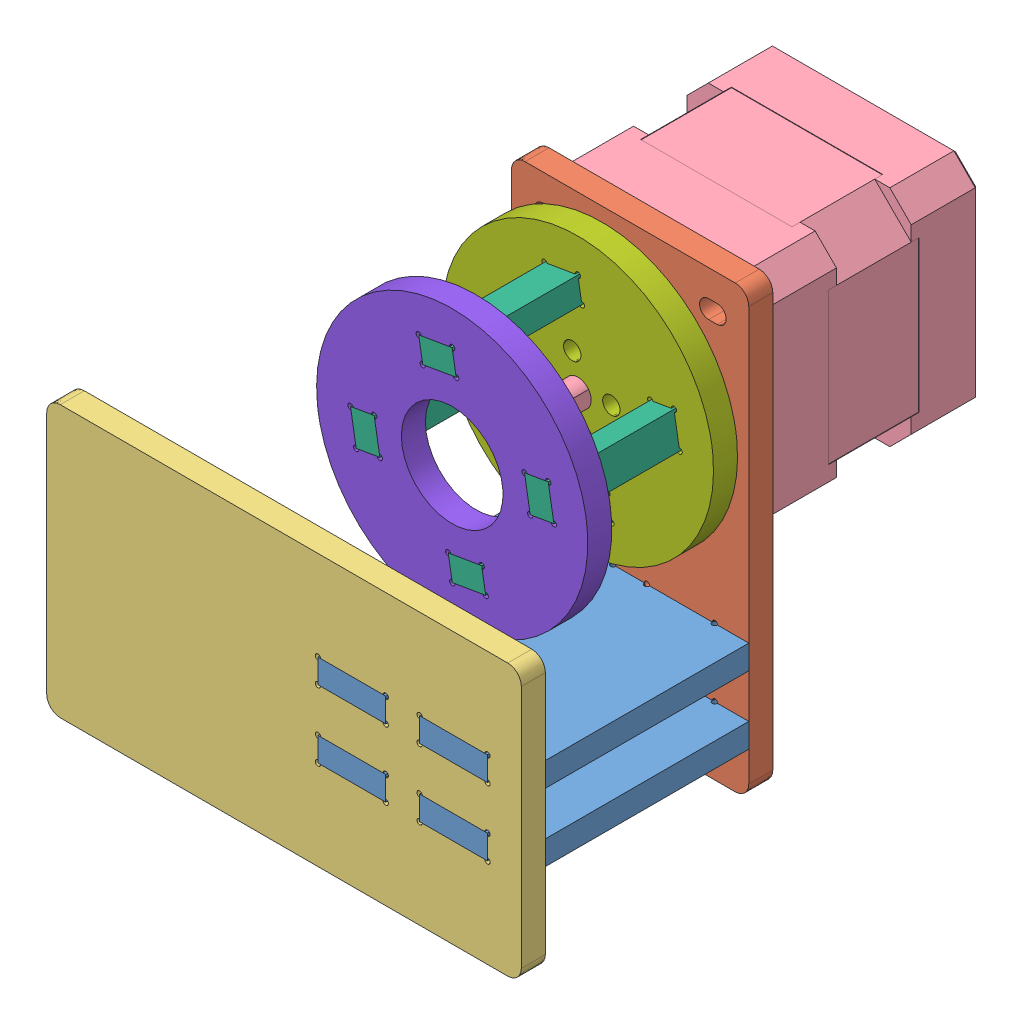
SolidWorks assembly Motor Mount.SLDASM, configuration Default (file format 8000). Lengths in mm.
Overall size (96.62 98.37 86.1).
13 component instances, 8 part files, 20 mates.
Components (placement in the parent):
- Connector-1: Connector.SLDPRT [Default] at (88.9785 7.3991 49.2004) x (0 0 -1) z (1 0 0) size (47.1 4.5 44.45)
- Connector-2: Connector.SLDPRT [Default] at (88.9785 20.0991 49.2004) x (0 0 -1) z (1 0 0) size (47.1 4.5 44.45)
- Motor Faceplate-1: Motor Faceplate.SLDPRT [Default] at (44.5285 -0.8009 6.6004) size (44.45 82.55 4.5)
- Wall Plate-1: Wall Plate.SLDPRT [Default] at (0.0785 41.3991 49.2004) x (0 -1 0) z (0 0 1) size (50.8 88.9 4.5)
- Steppermotor-1: Steppermotor.SLDPRT [Predeterminado] at (67.4035 59.6741 6.6004) x (0 1 0) z (0 0 -1) size (42 42 58.5)
- Motor Hub-1: Motor Hub.SLDPRT [Default] at (67.4035 59.6741 11.9464) x (0.16736 -0.985896 0) z (0 0 1) size (19.05 19.05 5.08)
- PulleyAssembly-1: PulleyAssembly.SLDASM [Default] at (66.5296 9.6823 6.4925) x (0.985896 0.16736 0) z (0 0 1) size (50.8 50.8 28.05)
  - Puller Spacer-1: Puller Spacer.SLDPRT [Default] at (28.0117 52.3155 10.534) x (0 0 1) z (0 -1 0) size (28.05 4.5 6.35)
  - Pulley Inner-1: Pulley Inner.SLDPRT [Default] at (9.2282 49.1405 10.534) size (50.8 50.8 4.5)
  - Puller Spacer-2: Puller Spacer.SLDPRT [Default] at (12.4032 30.3569 10.534) x (0 0 1) z (-1 0 0) size (28.05 4.5 6.35)
  - Puller Spacer-3: Puller Spacer.SLDPRT [Default] at (12.4032 63.4241 10.534) x (0 0 1) z (-1 0 0) size (28.05 4.5 6.35)
  - Puller Spacer-4: Puller Spacer.SLDPRT [Default] at (-9.5554 45.9655 10.534) x (0 0 1) z (0 1 0) size (28.05 4.5 6.35)
  - Pulley OuterFillet-1: Pulley OuterFillet.SLDPRT [Default] at (9.2282 49.1405 38.584) x (-1 0 0) z (0 0 -1) size (50.8 50.8 4.5)
Mates (geometry in assembly coordinates):
- Coincident2: coincident anti-aligned: plane of Connector-1 through (88.9785 11.8991 11.1004) normal (0 0 -1); plane of Motor Faceplate-1 through (44.5285 -0.8009 11.1004) normal (0 0 1)
- Parallel3: parallel aligned: plane of Connector-1 through (88.9785 11.8991 49.2004) normal (0 1 0); plane of Connector-2 through (88.9785 24.5991 49.2004) normal (0 1 0)
- Coincident6: coincident aligned: plane of Connector-2 through (88.9785 24.5991 49.2004) normal (1 0 0); plane of Motor Faceplate-1 through (88.9785 -0.8009 11.1004) normal (1 0 0)
- Parallel6: parallel aligned: plane of Connector-2 through (88.9785 24.5991 49.2004) normal (0 1 0); plane of Wall Plate-1 through (0.0785 41.3991 53.7004) normal (0 1 0)
- Parallel7: parallel aligned: plane of Motor Faceplate-1 through (44.5285 -0.8009 11.1004) normal (0 0 1); plane of Wall Plate-1 through (0.0785 41.3991 53.7004) normal (0 0 1)
- Coincident9: coincident anti-aligned: plane of Motor Faceplate-1 through (44.5285 -0.8009 6.6004) normal (0 0 -1); plane of Steppermotor-1 through (67.4035 59.6741 6.6004) normal (0 0 1)
- Concentric4: concentric anti-aligned: circle of Motor Faceplate-1; circle of Steppermotor-1
- Parallel10: parallel aligned: plane of Motor Faceplate-1 through (44.5285 81.7491 11.1004) normal (0 1 0); plane of Steppermotor-1 through (88.4035 80.6741 -32.3996) normal (0 1 0)
- Concentric6: concentric aligned: cylinder of Steppermotor-1 through (67.4035 59.6741 26.1004) axis (0 0 -1) radius 2.5; cylinder of Motor Hub-1 through (67.4035 59.6741 17.0264) axis (0 0 -1) radius 2.5
- Coincident14: coincident aligned: plane of Connector-2 through (88.9785 24.5991 6.6004) normal (0 0 -1); plane of Motor Faceplate-1 through (44.5285 -0.8009 6.6004) normal (0 0 -1)
- Coincident15: coincident anti-aligned: plane of Connector-2 through (88.9785 24.5991 49.2004) normal (0 1 0); plane of Motor Faceplate-1 through (44.5285 24.5991 6.6004) normal (0 -1 0)
- Coincident16: coincident aligned: plane of Connector-1 through (88.9785 11.8991 6.6004) normal (0 0 -1); plane of Motor Faceplate-1 through (44.5285 -0.8009 6.6004) normal (0 0 -1)
- Coincident17: coincident anti-aligned: plane of Connector-1 through (88.9785 7.3991 49.2004) normal (0 -1 0); plane of Motor Faceplate-1 through (44.5285 7.3991 6.6004) normal (0 1 0)
- Coincident18: coincident anti-aligned: plane of Connector-1 through (69.9285 11.8991 49.2004) normal (-1 0 0); plane of Motor Faceplate-1 through (69.9285 -0.8009 6.6004) normal (1 0 0)
- Coincident19: coincident anti-aligned: plane of Connector-2 through (82.6285 24.5991 49.2004) normal (1 0 0); plane of Wall Plate-1 through (82.6285 41.3991 53.7004) normal (-1 0 0)
- Coincident20: coincident aligned: plane of Connector-2 through (88.9785 24.5991 53.7004) normal (0 0 1); plane of Wall Plate-1 through (0.0785 41.3991 53.7004) normal (0 0 1)
- Coincident21: coincident anti-aligned: plane of Connector-2 through (88.9785 24.5991 49.2004) normal (0 1 0); plane of Wall Plate-1 through (0.0785 24.5991 53.7004) normal (0 -1 0)
- Concentric7: concentric aligned: cylinder of Steppermotor-1 through (67.4035 59.6741 26.1004) axis (0 0 -1) radius 2.5; cylinder of PulleyAssembly-1/Pulley Inner-1 through (67.4035 59.6741 21.5264) axis (0 0 -1) radius 2.5
- Concentric8: concentric aligned: circle of Motor Hub-1; circle of PulleyAssembly-1/Pulley Inner-1
- Coincident22: coincident anti-aligned: plane of Motor Hub-1 through (67.4035 59.6741 17.0264) normal (0 0 1); plane of PulleyAssembly-1/Pulley Inner-1 through (67.4035 59.6741 17.0264) normal (0 0 -1)
